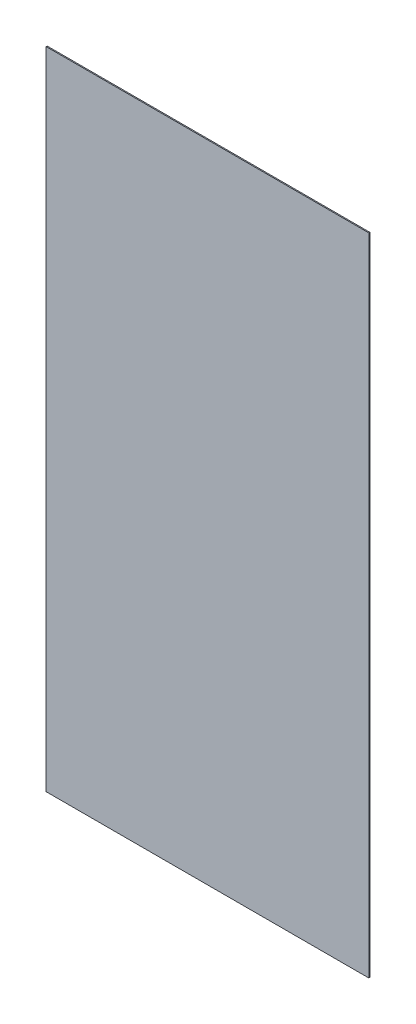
ISO-10303-21;
HEADER;
FILE_DESCRIPTION(('STEP AP214'),'2;1');
FILE_NAME('part.step','',(''),(''),'','','');
FILE_SCHEMA(('AUTOMOTIVE_DESIGN { 1 0 10303 214 1 1 1 1 }'));
ENDSEC;
DATA;
#1=APPLICATION_CONTEXT('core data for automotive mechanical design processes');
#2=APPLICATION_PROTOCOL_DEFINITION('international standard','automotive_design',2000,#1);
#3=PRODUCT_CONTEXT('',#1,'mechanical');
#4=PRODUCT('Part','Part','',(#3));
#5=PRODUCT_RELATED_PRODUCT_CATEGORY('part','',(#4));
#6=PRODUCT_DEFINITION_FORMATION('','',#4);
#7=PRODUCT_DEFINITION_CONTEXT('part definition',#1,'design');
#8=PRODUCT_DEFINITION('design','',#6,#7);
#9=PRODUCT_DEFINITION_SHAPE('','',#8);
#10=(LENGTH_UNIT() NAMED_UNIT(*) SI_UNIT(.MILLI.,.METRE.));
#11=(NAMED_UNIT(*) PLANE_ANGLE_UNIT() SI_UNIT($,.RADIAN.));
#12=(NAMED_UNIT(*) SI_UNIT($,.STERADIAN.) SOLID_ANGLE_UNIT());
#13=UNCERTAINTY_MEASURE_WITH_UNIT(LENGTH_MEASURE(1.E-05),#10,'distance_accuracy_value','');
#14=(GEOMETRIC_REPRESENTATION_CONTEXT(3) GLOBAL_UNCERTAINTY_ASSIGNED_CONTEXT((#13)) GLOBAL_UNIT_ASSIGNED_CONTEXT((#10,
#11,#12)) REPRESENTATION_CONTEXT('',''));
#15=CARTESIAN_POINT('',(0.,0.,0.));
#16=DIRECTION('',(0.,0.,1.));
#17=DIRECTION('',(1.,0.,0.));
#18=AXIS2_PLACEMENT_3D('',#15,#16,#17);
#19=CARTESIAN_POINT('',(0.,0.,4.));
#20=DIRECTION('',(1.,0.,0.));
#21=DIRECTION('',(0.,0.,-1.));
#22=AXIS2_PLACEMENT_3D('',#19,#20,#21);
#23=PLANE('',#22);
#24=DIRECTION('',(0.,-1.,0.));
#25=VECTOR('',#24,1.);
#26=CARTESIAN_POINT('',(0.,0.,0.));
#27=LINE('',#26,#25);
#28=CARTESIAN_POINT('',(0.,2440.,0.));
#29=VERTEX_POINT('',#28);
#30=CARTESIAN_POINT('',(0.,0.,0.));
#31=VERTEX_POINT('',#30);
#32=EDGE_CURVE('E96',#29,#31,#27,.T.);
#33=ORIENTED_EDGE('',*,*,#32,.T.);
#34=DIRECTION('',(0.,0.,-1.));
#35=VECTOR('',#34,1.);
#36=CARTESIAN_POINT('',(0.,0.,4.));
#37=LINE('',#36,#35);
#38=CARTESIAN_POINT('',(0.,0.,4.));
#39=VERTEX_POINT('',#38);
#40=EDGE_CURVE('E11',#39,#31,#37,.T.);
#41=ORIENTED_EDGE('',*,*,#40,.F.);
#42=DIRECTION('',(0.,-1.,0.));
#43=VECTOR('',#42,1.);
#44=CARTESIAN_POINT('',(0.,0.,4.));
#45=LINE('',#44,#43);
#46=CARTESIAN_POINT('',(0.,2440.,4.));
#47=VERTEX_POINT('',#46);
#48=EDGE_CURVE('E84',#47,#39,#45,.T.);
#49=ORIENTED_EDGE('',*,*,#48,.F.);
#50=DIRECTION('',(0.,0.,-1.));
#51=VECTOR('',#50,1.);
#52=CARTESIAN_POINT('',(0.,2440.,4.));
#53=LINE('',#52,#51);
#54=EDGE_CURVE('E92',#47,#29,#53,.T.);
#55=ORIENTED_EDGE('',*,*,#54,.T.);
#56=EDGE_LOOP('',(#33,#41,#49,#55));
#57=FACE_BOUND('',#56,.T.);
#58=ADVANCED_FACE('F33',(#57),#23,.F.);
#59=CARTESIAN_POINT('',(0.,0.,4.));
#60=DIRECTION('',(0.,1.,0.));
#61=DIRECTION('',(0.,0.,1.));
#62=AXIS2_PLACEMENT_3D('',#59,#60,#61);
#63=PLANE('',#62);
#64=DIRECTION('',(1.,0.,0.));
#65=VECTOR('',#64,1.);
#66=CARTESIAN_POINT('',(0.,0.,0.));
#67=LINE('',#66,#65);
#68=CARTESIAN_POINT('',(1220.,0.,0.));
#69=VERTEX_POINT('',#68);
#70=EDGE_CURVE('E88',#31,#69,#67,.T.);
#71=ORIENTED_EDGE('',*,*,#70,.T.);
#72=DIRECTION('',(0.,0.,-1.));
#73=VECTOR('',#72,1.);
#74=CARTESIAN_POINT('',(1220.,0.,4.));
#75=LINE('',#74,#73);
#76=CARTESIAN_POINT('',(1220.,0.,4.));
#77=VERTEX_POINT('',#76);
#78=EDGE_CURVE('E41',#77,#69,#75,.T.);
#79=ORIENTED_EDGE('',*,*,#78,.F.);
#80=DIRECTION('',(1.,0.,0.));
#81=VECTOR('',#80,1.);
#82=CARTESIAN_POINT('',(0.,0.,4.));
#83=LINE('',#82,#81);
#84=EDGE_CURVE('E79',#39,#77,#83,.T.);
#85=ORIENTED_EDGE('',*,*,#84,.F.);
#86=ORIENTED_EDGE('',*,*,#40,.T.);
#87=EDGE_LOOP('',(#71,#79,#85,#86));
#88=FACE_BOUND('',#87,.T.);
#89=ADVANCED_FACE('F87',(#88),#63,.F.);
#90=CARTESIAN_POINT('',(1220.,0.,4.));
#91=DIRECTION('',(-1.,0.,0.));
#92=DIRECTION('',(0.,0.,1.));
#93=AXIS2_PLACEMENT_3D('',#90,#91,#92);
#94=PLANE('',#93);
#95=DIRECTION('',(0.,1.,0.));
#96=VECTOR('',#95,1.);
#97=CARTESIAN_POINT('',(1220.,0.,0.));
#98=LINE('',#97,#96);
#99=CARTESIAN_POINT('',(1220.,2440.,0.));
#100=VERTEX_POINT('',#99);
#101=EDGE_CURVE('E66',#69,#100,#98,.T.);
#102=ORIENTED_EDGE('',*,*,#101,.T.);
#103=DIRECTION('',(0.,0.,-1.));
#104=VECTOR('',#103,1.);
#105=CARTESIAN_POINT('',(1220.,2440.,4.));
#106=LINE('',#105,#104);
#107=CARTESIAN_POINT('',(1220.,2440.,4.));
#108=VERTEX_POINT('',#107);
#109=EDGE_CURVE('E89',#108,#100,#106,.T.);
#110=ORIENTED_EDGE('',*,*,#109,.F.);
#111=DIRECTION('',(0.,1.,0.));
#112=VECTOR('',#111,1.);
#113=CARTESIAN_POINT('',(1220.,0.,4.));
#114=LINE('',#113,#112);
#115=EDGE_CURVE('E82',#77,#108,#114,.T.);
#116=ORIENTED_EDGE('',*,*,#115,.F.);
#117=ORIENTED_EDGE('',*,*,#78,.T.);
#118=EDGE_LOOP('',(#102,#110,#116,#117));
#119=FACE_BOUND('',#118,.T.);
#120=ADVANCED_FACE('F90',(#119),#94,.F.);
#121=CARTESIAN_POINT('',(0.,2440.,4.));
#122=DIRECTION('',(0.,-1.,0.));
#123=DIRECTION('',(0.,0.,-1.));
#124=AXIS2_PLACEMENT_3D('',#121,#122,#123);
#125=PLANE('',#124);
#126=DIRECTION('',(-1.,0.,0.));
#127=VECTOR('',#126,1.);
#128=CARTESIAN_POINT('',(0.,2440.,0.));
#129=LINE('',#128,#127);
#130=EDGE_CURVE('E72',#100,#29,#129,.T.);
#131=ORIENTED_EDGE('',*,*,#130,.T.);
#132=ORIENTED_EDGE('',*,*,#54,.F.);
#133=DIRECTION('',(-1.,0.,0.));
#134=VECTOR('',#133,1.);
#135=CARTESIAN_POINT('',(0.,2440.,4.));
#136=LINE('',#135,#134);
#137=EDGE_CURVE('E49',#108,#47,#136,.T.);
#138=ORIENTED_EDGE('',*,*,#137,.F.);
#139=ORIENTED_EDGE('',*,*,#109,.T.);
#140=EDGE_LOOP('',(#131,#132,#138,#139));
#141=FACE_BOUND('',#140,.T.);
#142=ADVANCED_FACE('F103',(#141),#125,.F.);
#143=CARTESIAN_POINT('',(0.,0.,4.));
#144=DIRECTION('',(0.,0.,-1.));
#145=DIRECTION('',(-1.,0.,0.));
#146=AXIS2_PLACEMENT_3D('',#143,#144,#145);
#147=PLANE('',#146);
#148=ORIENTED_EDGE('',*,*,#48,.T.);
#149=ORIENTED_EDGE('',*,*,#84,.T.);
#150=ORIENTED_EDGE('',*,*,#115,.T.);
#151=ORIENTED_EDGE('',*,*,#137,.T.);
#152=EDGE_LOOP('',(#148,#149,#150,#151));
#153=FACE_BOUND('',#152,.T.);
#154=ADVANCED_FACE('F80',(#153),#147,.F.);
#155=CARTESIAN_POINT('',(0.,0.,0.));
#156=DIRECTION('',(0.,0.,-1.));
#157=DIRECTION('',(-1.,0.,0.));
#158=AXIS2_PLACEMENT_3D('',#155,#156,#157);
#159=PLANE('',#158);
#160=ORIENTED_EDGE('',*,*,#32,.F.);
#161=ORIENTED_EDGE('',*,*,#130,.F.);
#162=ORIENTED_EDGE('',*,*,#101,.F.);
#163=ORIENTED_EDGE('',*,*,#70,.F.);
#164=EDGE_LOOP('',(#160,#161,#162,#163));
#165=FACE_BOUND('',#164,.T.);
#166=ADVANCED_FACE('F106',(#165),#159,.T.);
#167=CLOSED_SHELL('',(#58,#89,#120,#142,#154,#166));
#168=MANIFOLD_SOLID_BREP('B2',#167);
#169=ADVANCED_BREP_SHAPE_REPRESENTATION('',(#18,#168),#14);
#170=SHAPE_DEFINITION_REPRESENTATION(#9,#169);
ENDSEC;
END-ISO-10303-21;
